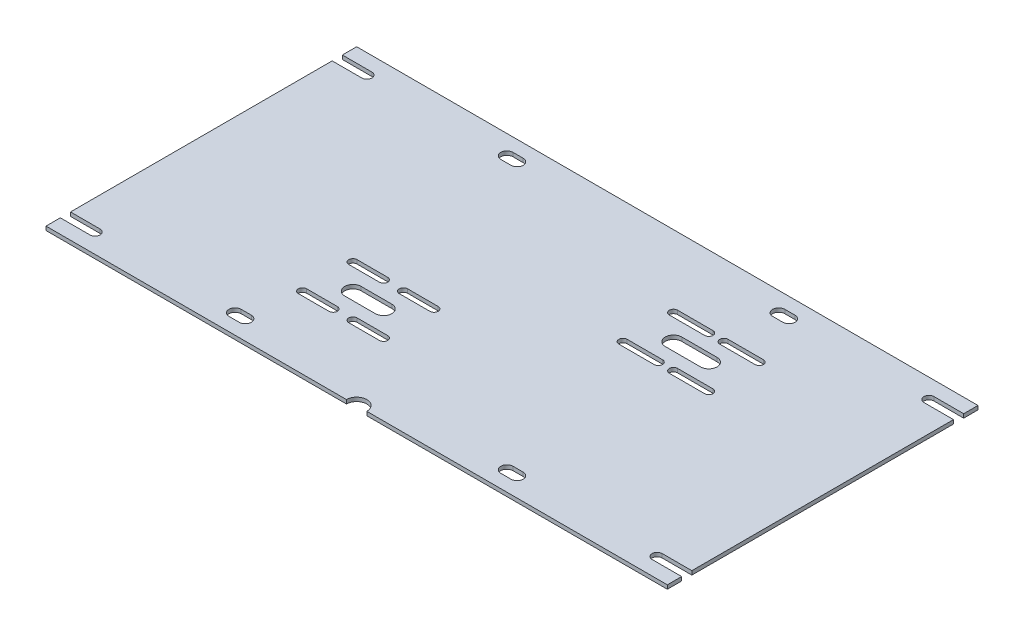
from build123d import *

# Parameters (mm, degrees)
CROQUIS1_W              = 304.8
CROQUIS1_H              = 152.4
SALIENTE_EXTRUIR1_DEPTH = 1.9
CUT_EXTRUDE1_DEPTH      = 171.398973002
CORTAR_EXTRUIR1_DEPTH   = 171.398973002
CROQUIS11_R             = 5
CORTAR_EXTRUIR3_DEPTH   = 10


with BuildPart() as part:
    # Croquis1 → Saliente-Extruir1 (new body)
    with BuildSketch(Plane(origin=(0, 0, 0), x_dir=(1, 0, 0), z_dir=(0, 1, 0))):
        Rectangle(CROQUIS1_W, CROQUIS1_H)
    extrude(amount=SALIENTE_EXTRUIR1_DEPTH)

    # Sketch1 → Cut-Extrude1 (cut, through all)
    with BuildSketch(Plane(origin=(0, 1.9, 0), x_dir=(1, 0, 0), z_dir=(0, 1, 0))):
        with BuildLine():
            Line((-152.4, 69.175), (-137.875, 69.175))
            ThreePointArc((-137.875, 69.175), (-135.375, 66.675), (-137.875, 64.175))
            Line((-137.875, 64.175), (-147.875, 64.175))
            Line((-147.875, 64.175), (-152.4, 64.175))
            Line((-152.4, 64.175), (-152.4, 69.175))
        make_face()
        with BuildLine():
            Line((-69.175, 69.675), (-64.175, 69.675))
            ThreePointArc((-64.175, 69.675), (-61.175, 66.675), (-64.175, 63.675))
            Line((-64.175, 63.675), (-69.175, 63.675))
            ThreePointArc((-69.175, 63.675), (-72.175, 66.675), (-69.175, 69.675))
        make_face()
        with BuildLine():
            Line((69.175, 69.675), (64.175, 69.675))
            ThreePointArc((64.175, 69.675), (61.175, 66.675), (64.175, 63.675))
            Line((64.175, 63.675), (69.175, 63.675))
            ThreePointArc((69.175, 63.675), (72.175, 66.675), (69.175, 69.675))
        make_face()
        with BuildLine():
            Line((152.4, 64.175), (147.875, 64.175))
            Line((147.875, 64.175), (137.875, 64.175))
            ThreePointArc((137.875, 64.175), (135.375, 66.675), (137.875, 69.175))
            Line((137.875, 69.175), (152.4, 69.175))
            Line((152.4, 69.175), (152.4, 64.175))
        make_face()
        with BuildLine():
            Line((-69.175, -69.675), (-64.175, -69.675))
            ThreePointArc((-64.175, -69.675), (-61.175, -66.675), (-64.175, -63.675))
            Line((-64.175, -63.675), (-69.175, -63.675))
            ThreePointArc((-69.175, -63.675), (-72.175, -66.675), (-69.175, -69.675))
        make_face()
        with BuildLine():
            Line((69.175, -69.675), (64.175, -69.675))
            ThreePointArc((64.175, -69.675), (61.175, -66.675), (64.175, -63.675))
            Line((64.175, -63.675), (69.175, -63.675))
            ThreePointArc((69.175, -63.675), (72.175, -66.675), (69.175, -69.675))
        make_face()
        with BuildLine():
            Line((152.4, -69.175), (137.875, -69.175))
            ThreePointArc((137.875, -69.175), (135.375, -66.675), (137.875, -64.175))
            Line((137.875, -64.175), (147.875, -64.175))
            Line((147.875, -64.175), (152.4, -64.175))
            Line((152.4, -64.175), (152.4, -69.175))
        make_face()
        with BuildLine():
            Line((-152.4, -64.175), (-147.875, -64.175))
            Line((-147.875, -64.175), (-137.875, -64.175))
            ThreePointArc((-137.875, -64.175), (-135.375, -66.675), (-137.875, -69.175))
            Line((-137.875, -69.175), (-152.4, -69.175))
            Line((-152.4, -69.175), (-152.4, -64.175))
        make_face()
    extrude(amount=-CUT_EXTRUDE1_DEPTH, mode=Mode.SUBTRACT)

    # Croquis6 → Cortar-Extruir1 (cut, through all)
    with BuildSketch(Plane(origin=(0, 1.9, 0), x_dir=(1, 0, 0), z_dir=(0, 1, 0))):
        with BuildLine():
            Line((80.342864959, 38.899368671), (63.022578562, 38.899368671))
            ThreePointArc((63.022578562, 38.899368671), (60.972578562, 40.949368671), (63.022578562, 42.999368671))
            Line((63.022578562, 42.999368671), (80.342864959, 42.999368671))
            ThreePointArc((80.342864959, 42.999368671), (82.392864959, 40.949368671), (80.342864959, 38.899368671))
        make_face()
        with BuildLine():
            Line((67.968496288, 24.525), (50.648209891, 24.525))
            ThreePointArc((50.648209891, 24.525), (46.598209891, 28.575), (50.648209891, 32.625))
            Line((50.648209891, 32.625), (67.968496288, 32.625))
            ThreePointArc((67.968496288, 32.625), (72.018496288, 28.575), (67.968496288, 24.525))
        make_face()
        with BuildLine():
            Line((55.594127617, 38.899368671), (38.27384122, 38.899368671))
            ThreePointArc((38.27384122, 38.899368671), (36.22384122, 40.949368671), (38.27384122, 42.999368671))
            Line((38.27384122, 42.999368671), (55.594127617, 42.999368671))
            ThreePointArc((55.594127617, 42.999368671), (57.644127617, 40.949368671), (55.594127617, 38.899368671))
        make_face()
        with BuildLine():
            Line((80.342864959, 14.150631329), (63.022578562, 14.150631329))
            ThreePointArc((63.022578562, 14.150631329), (60.972578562, 16.200631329), (63.022578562, 18.250631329))
            Line((63.022578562, 18.250631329), (80.342864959, 18.250631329))
            ThreePointArc((80.342864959, 18.250631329), (82.392864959, 16.200631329), (80.342864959, 14.150631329))
        make_face()
        with BuildLine():
            Line((55.594127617, 14.150631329), (38.27384122, 14.150631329))
            ThreePointArc((38.27384122, 14.150631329), (36.22384122, 16.200631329), (38.27384122, 18.250631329))
            Line((38.27384122, 18.250631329), (55.594127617, 18.250631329))
            ThreePointArc((55.594127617, 18.250631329), (57.644127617, 16.200631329), (55.594127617, 14.150631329))
        make_face()
        with BuildLine():
            Line((-46.798662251, -14.150631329), (-61.830643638, -14.150631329))
            ThreePointArc((-61.830643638, -14.150631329), (-63.880643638, -16.200631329), (-61.830643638, -18.250631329))
            Line((-61.830643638, -18.250631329), (-46.798662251, -18.250631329))
            ThreePointArc((-46.798662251, -18.250631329), (-44.748662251, -16.200631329), (-46.798662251, -14.150631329))
        make_face()
        with BuildLine():
            Line((-22.049924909, -14.150631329), (-37.081906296, -14.150631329))
            ThreePointArc((-37.081906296, -14.150631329), (-39.131906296, -16.200631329), (-37.081906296, -18.250631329))
            Line((-37.081906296, -18.250631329), (-22.049924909, -18.250631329))
            ThreePointArc((-22.049924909, -18.250631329), (-19.999924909, -16.200631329), (-22.049924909, -14.150631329))
        make_face()
        with BuildLine():
            Line((-34.42429358, -24.525), (-49.456274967, -24.525))
            ThreePointArc((-49.456274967, -24.525), (-53.506274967, -28.575), (-49.456274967, -32.625))
            Line((-49.456274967, -32.625), (-34.42429358, -32.625))
            ThreePointArc((-34.42429358, -32.625), (-30.37429358, -28.575), (-34.42429358, -24.525))
        make_face()
        with BuildLine():
            Line((-22.049924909, -42.999368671), (-37.081906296, -42.999368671))
            ThreePointArc((-37.081906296, -42.999368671), (-39.131906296, -40.949368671), (-37.081906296, -38.899368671))
            Line((-37.081906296, -38.899368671), (-22.049924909, -38.899368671))
            ThreePointArc((-22.049924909, -38.899368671), (-19.999924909, -40.949368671), (-22.049924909, -42.999368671))
        make_face()
        with BuildLine():
            Line((-46.798662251, -42.999368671), (-61.830643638, -42.999368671))
            ThreePointArc((-61.830643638, -42.999368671), (-63.880643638, -40.949368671), (-61.830643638, -38.899368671))
            Line((-61.830643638, -38.899368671), (-46.798662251, -38.899368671))
            ThreePointArc((-46.798662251, -38.899368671), (-44.748662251, -40.949368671), (-46.798662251, -42.999368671))
        make_face()
    extrude(amount=-CORTAR_EXTRUIR1_DEPTH, mode=Mode.SUBTRACT)

    # Croquis11 → Cortar-Extruir3 (cut)
    with BuildSketch(Plane(origin=(0, 1.9, 0), x_dir=(1, 0, 0), z_dir=(0, 1, 0))):
        with Locations((0, -76.2)):
            Circle(CROQUIS11_R)
    extrude(amount=-CORTAR_EXTRUIR3_DEPTH, mode=Mode.SUBTRACT)


solid = part.part
